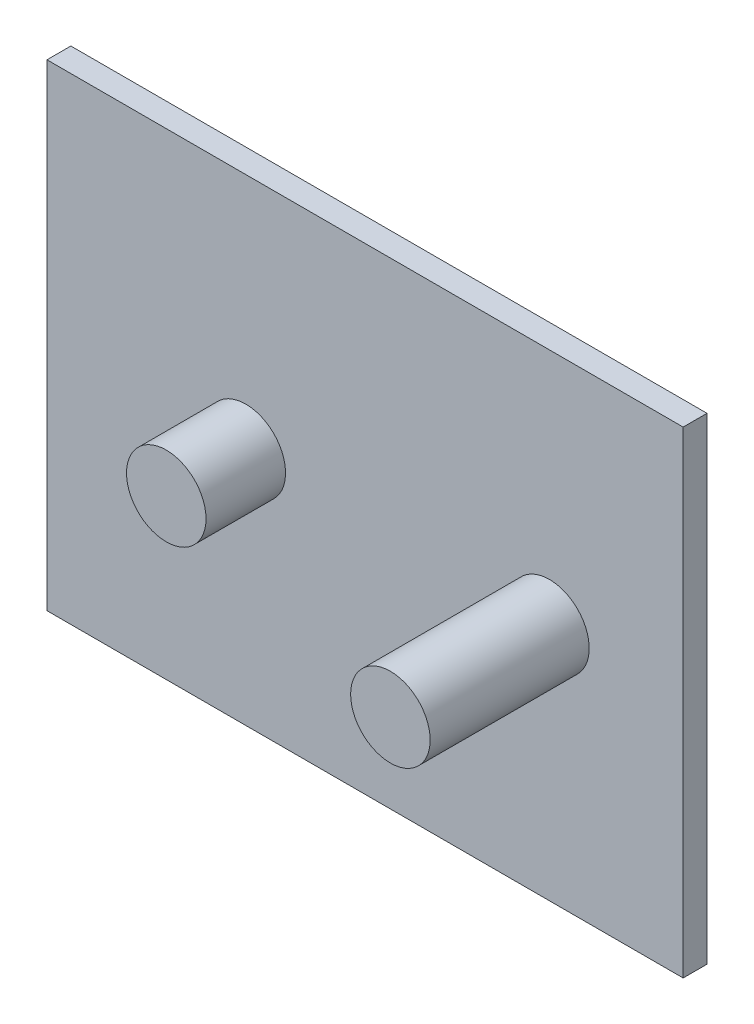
ISO-10303-21;
HEADER;
FILE_DESCRIPTION(('STEP AP214'),'2;1');
FILE_NAME('part.step','',(''),(''),'','','');
FILE_SCHEMA(('AUTOMOTIVE_DESIGN { 1 0 10303 214 1 1 1 1 }'));
ENDSEC;
DATA;
#1=APPLICATION_CONTEXT('core data for automotive mechanical design processes');
#2=APPLICATION_PROTOCOL_DEFINITION('international standard','automotive_design',2000,#1);
#3=PRODUCT_CONTEXT('',#1,'mechanical');
#4=PRODUCT('Part','Part','',(#3));
#5=PRODUCT_RELATED_PRODUCT_CATEGORY('part','',(#4));
#6=PRODUCT_DEFINITION_FORMATION('','',#4);
#7=PRODUCT_DEFINITION_CONTEXT('part definition',#1,'design');
#8=PRODUCT_DEFINITION('design','',#6,#7);
#9=PRODUCT_DEFINITION_SHAPE('','',#8);
#10=(LENGTH_UNIT() NAMED_UNIT(*) SI_UNIT(.MILLI.,.METRE.));
#11=(NAMED_UNIT(*) PLANE_ANGLE_UNIT() SI_UNIT($,.RADIAN.));
#12=(NAMED_UNIT(*) SI_UNIT($,.STERADIAN.) SOLID_ANGLE_UNIT());
#13=UNCERTAINTY_MEASURE_WITH_UNIT(LENGTH_MEASURE(1.E-05),#10,'distance_accuracy_value','');
#14=(GEOMETRIC_REPRESENTATION_CONTEXT(3) GLOBAL_UNCERTAINTY_ASSIGNED_CONTEXT((#13)) GLOBAL_UNIT_ASSIGNED_CONTEXT((#10,
#11,#12)) REPRESENTATION_CONTEXT('',''));
#15=CARTESIAN_POINT('',(0.,0.,0.));
#16=DIRECTION('',(0.,0.,1.));
#17=DIRECTION('',(1.,0.,0.));
#18=AXIS2_PLACEMENT_3D('',#15,#16,#17);
#19=CARTESIAN_POINT('',(0.,60.,3.));
#20=DIRECTION('',(0.,0.,-1.));
#21=DIRECTION('',(-1.,0.,0.));
#22=AXIS2_PLACEMENT_3D('',#19,#20,#21);
#23=PLANE('',#22);
#24=CARTESIAN_POINT('',(25.,30.,3.));
#25=DIRECTION('',(0.,0.,-1.));
#26=DIRECTION('',(-1.,0.,0.));
#27=AXIS2_PLACEMENT_3D('',#24,#25,#26);
#28=CIRCLE('',#27,5.);
#29=CARTESIAN_POINT('',(20.,30.,3.));
#30=VERTEX_POINT('',#29);
#31=EDGE_CURVE('E48',#30,#30,#28,.F.);
#32=ORIENTED_EDGE('',*,*,#31,.F.);
#33=EDGE_LOOP('',(#32));
#34=FACE_BOUND('',#33,.T.);
#35=DIRECTION('',(0.,-1.,0.));
#36=VECTOR('',#35,1.);
#37=CARTESIAN_POINT('',(0.,0.,3.));
#38=LINE('',#37,#36);
#39=CARTESIAN_POINT('',(0.,60.,3.));
#40=VERTEX_POINT('',#39);
#41=CARTESIAN_POINT('',(0.,0.,3.));
#42=VERTEX_POINT('',#41);
#43=EDGE_CURVE('E112',#40,#42,#38,.T.);
#44=ORIENTED_EDGE('',*,*,#43,.T.);
#45=DIRECTION('',(1.,0.,0.));
#46=VECTOR('',#45,1.);
#47=CARTESIAN_POINT('',(0.,0.,3.));
#48=LINE('',#47,#46);
#49=CARTESIAN_POINT('',(80.,0.,3.));
#50=VERTEX_POINT('',#49);
#51=EDGE_CURVE('E95',#42,#50,#48,.T.);
#52=ORIENTED_EDGE('',*,*,#51,.T.);
#53=DIRECTION('',(0.,1.,0.));
#54=VECTOR('',#53,1.);
#55=CARTESIAN_POINT('',(80.,0.,3.));
#56=LINE('',#55,#54);
#57=CARTESIAN_POINT('',(80.,60.,3.));
#58=VERTEX_POINT('',#57);
#59=EDGE_CURVE('E60',#50,#58,#56,.T.);
#60=ORIENTED_EDGE('',*,*,#59,.T.);
#61=DIRECTION('',(-1.,0.,0.));
#62=VECTOR('',#61,1.);
#63=CARTESIAN_POINT('',(0.,60.,3.));
#64=LINE('',#63,#62);
#65=EDGE_CURVE('E55',#58,#40,#64,.T.);
#66=ORIENTED_EDGE('',*,*,#65,.T.);
#67=EDGE_LOOP('',(#44,#52,#60,#66));
#68=FACE_BOUND('',#67,.T.);
#69=CARTESIAN_POINT('',(63.183766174,30.,3.));
#70=DIRECTION('',(0.,0.,-1.));
#71=DIRECTION('',(-1.,0.,0.));
#72=AXIS2_PLACEMENT_3D('',#69,#70,#71);
#73=CIRCLE('',#72,5.);
#74=CARTESIAN_POINT('',(58.183766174,30.,3.));
#75=VERTEX_POINT('',#74);
#76=EDGE_CURVE('E11',#75,#75,#73,.F.);
#77=ORIENTED_EDGE('',*,*,#76,.F.);
#78=EDGE_LOOP('',(#77));
#79=FACE_BOUND('',#78,.T.);
#80=ADVANCED_FACE('F40',(#34,#68,#79),#23,.F.);
#81=CARTESIAN_POINT('',(0.,0.,3.));
#82=DIRECTION('',(1.,0.,0.));
#83=DIRECTION('',(0.,0.,-1.));
#84=AXIS2_PLACEMENT_3D('',#81,#82,#83);
#85=PLANE('',#84);
#86=DIRECTION('',(0.,-1.,0.));
#87=VECTOR('',#86,1.);
#88=CARTESIAN_POINT('',(0.,0.,0.));
#89=LINE('',#88,#87);
#90=CARTESIAN_POINT('',(0.,60.,0.));
#91=VERTEX_POINT('',#90);
#92=CARTESIAN_POINT('',(0.,0.,0.));
#93=VERTEX_POINT('',#92);
#94=EDGE_CURVE('E86',#91,#93,#89,.T.);
#95=ORIENTED_EDGE('',*,*,#94,.T.);
#96=DIRECTION('',(0.,0.,-1.));
#97=VECTOR('',#96,1.);
#98=CARTESIAN_POINT('',(0.,0.,3.));
#99=LINE('',#98,#97);
#100=EDGE_CURVE('E93',#42,#93,#99,.T.);
#101=ORIENTED_EDGE('',*,*,#100,.F.);
#102=ORIENTED_EDGE('',*,*,#43,.F.);
#103=DIRECTION('',(0.,0.,-1.));
#104=VECTOR('',#103,1.);
#105=CARTESIAN_POINT('',(0.,60.,3.));
#106=LINE('',#105,#104);
#107=EDGE_CURVE('E101',#40,#91,#106,.T.);
#108=ORIENTED_EDGE('',*,*,#107,.T.);
#109=EDGE_LOOP('',(#95,#101,#102,#108));
#110=FACE_BOUND('',#109,.T.);
#111=ADVANCED_FACE('F42',(#110),#85,.F.);
#112=CARTESIAN_POINT('',(0.,0.,3.));
#113=DIRECTION('',(0.,1.,0.));
#114=DIRECTION('',(0.,0.,1.));
#115=AXIS2_PLACEMENT_3D('',#112,#113,#114);
#116=PLANE('',#115);
#117=DIRECTION('',(1.,0.,0.));
#118=VECTOR('',#117,1.);
#119=CARTESIAN_POINT('',(0.,0.,0.));
#120=LINE('',#119,#118);
#121=CARTESIAN_POINT('',(80.,0.,0.));
#122=VERTEX_POINT('',#121);
#123=EDGE_CURVE('E81',#93,#122,#120,.T.);
#124=ORIENTED_EDGE('',*,*,#123,.T.);
#125=DIRECTION('',(0.,0.,-1.));
#126=VECTOR('',#125,1.);
#127=CARTESIAN_POINT('',(80.,0.,3.));
#128=LINE('',#127,#126);
#129=EDGE_CURVE('E98',#50,#122,#128,.T.);
#130=ORIENTED_EDGE('',*,*,#129,.F.);
#131=ORIENTED_EDGE('',*,*,#51,.F.);
#132=ORIENTED_EDGE('',*,*,#100,.T.);
#133=EDGE_LOOP('',(#124,#130,#131,#132));
#134=FACE_BOUND('',#133,.T.);
#135=ADVANCED_FACE('F94',(#134),#116,.F.);
#136=CARTESIAN_POINT('',(80.,0.,3.));
#137=DIRECTION('',(-1.,0.,0.));
#138=DIRECTION('',(0.,0.,1.));
#139=AXIS2_PLACEMENT_3D('',#136,#137,#138);
#140=PLANE('',#139);
#141=DIRECTION('',(0.,1.,0.));
#142=VECTOR('',#141,1.);
#143=CARTESIAN_POINT('',(80.,0.,0.));
#144=LINE('',#143,#142);
#145=CARTESIAN_POINT('',(80.,60.,0.));
#146=VERTEX_POINT('',#145);
#147=EDGE_CURVE('E87',#122,#146,#144,.T.);
#148=ORIENTED_EDGE('',*,*,#147,.T.);
#149=DIRECTION('',(0.,0.,-1.));
#150=VECTOR('',#149,1.);
#151=CARTESIAN_POINT('',(80.,60.,3.));
#152=LINE('',#151,#150);
#153=EDGE_CURVE('E118',#58,#146,#152,.T.);
#154=ORIENTED_EDGE('',*,*,#153,.F.);
#155=ORIENTED_EDGE('',*,*,#59,.F.);
#156=ORIENTED_EDGE('',*,*,#129,.T.);
#157=EDGE_LOOP('',(#148,#154,#155,#156));
#158=FACE_BOUND('',#157,.T.);
#159=ADVANCED_FACE('F156',(#158),#140,.F.);
#160=CARTESIAN_POINT('',(0.,60.,3.));
#161=DIRECTION('',(0.,-1.,0.));
#162=DIRECTION('',(0.,0.,-1.));
#163=AXIS2_PLACEMENT_3D('',#160,#161,#162);
#164=PLANE('',#163);
#165=DIRECTION('',(-1.,0.,0.));
#166=VECTOR('',#165,1.);
#167=CARTESIAN_POINT('',(0.,60.,0.));
#168=LINE('',#167,#166);
#169=EDGE_CURVE('E110',#146,#91,#168,.T.);
#170=ORIENTED_EDGE('',*,*,#169,.T.);
#171=ORIENTED_EDGE('',*,*,#107,.F.);
#172=ORIENTED_EDGE('',*,*,#65,.F.);
#173=ORIENTED_EDGE('',*,*,#153,.T.);
#174=EDGE_LOOP('',(#170,#171,#172,#173));
#175=FACE_BOUND('',#174,.T.);
#176=ADVANCED_FACE('F152',(#175),#164,.F.);
#177=CARTESIAN_POINT('',(0.,60.,0.));
#178=DIRECTION('',(0.,0.,-1.));
#179=DIRECTION('',(-1.,0.,0.));
#180=AXIS2_PLACEMENT_3D('',#177,#178,#179);
#181=PLANE('',#180);
#182=ORIENTED_EDGE('',*,*,#94,.F.);
#183=ORIENTED_EDGE('',*,*,#169,.F.);
#184=ORIENTED_EDGE('',*,*,#147,.F.);
#185=ORIENTED_EDGE('',*,*,#123,.F.);
#186=EDGE_LOOP('',(#182,#183,#184,#185));
#187=FACE_BOUND('',#186,.T.);
#188=ADVANCED_FACE('F83',(#187),#181,.T.);
#189=CARTESIAN_POINT('',(25.,30.,13.));
#190=DIRECTION('',(0.,0.,-1.));
#191=DIRECTION('',(-1.,0.,0.));
#192=AXIS2_PLACEMENT_3D('',#189,#190,#191);
#193=CYLINDRICAL_SURFACE('',#192,5.);
#194=CARTESIAN_POINT('',(25.,30.,13.));
#195=DIRECTION('',(0.,0.,1.));
#196=DIRECTION('',(1.,0.,0.));
#197=AXIS2_PLACEMENT_3D('',#194,#195,#196);
#198=CIRCLE('',#197,5.);
#199=CARTESIAN_POINT('',(30.,30.,13.));
#200=VERTEX_POINT('',#199);
#201=EDGE_CURVE('E102',#200,#200,#198,.T.);
#202=ORIENTED_EDGE('',*,*,#201,.F.);
#203=EDGE_LOOP('',(#202));
#204=FACE_BOUND('',#203,.T.);
#205=ORIENTED_EDGE('',*,*,#31,.T.);
#206=EDGE_LOOP('',(#205));
#207=FACE_BOUND('',#206,.T.);
#208=ADVANCED_FACE('F124',(#204,#207),#193,.T.);
#209=CARTESIAN_POINT('',(25.,30.,13.));
#210=DIRECTION('',(0.,0.,1.));
#211=DIRECTION('',(1.,0.,0.));
#212=AXIS2_PLACEMENT_3D('',#209,#210,#211);
#213=PLANE('',#212);
#214=ORIENTED_EDGE('',*,*,#201,.T.);
#215=EDGE_LOOP('',(#214));
#216=FACE_BOUND('',#215,.T.);
#217=ADVANCED_FACE('F135',(#216),#213,.T.);
#218=CARTESIAN_POINT('',(63.183766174,30.,13.));
#219=DIRECTION('',(0.,0.,-1.));
#220=DIRECTION('',(-1.,0.,0.));
#221=AXIS2_PLACEMENT_3D('',#218,#219,#220);
#222=CYLINDRICAL_SURFACE('',#221,5.);
#223=ORIENTED_EDGE('',*,*,#76,.T.);
#224=EDGE_LOOP('',(#223));
#225=FACE_BOUND('',#224,.T.);
#226=CARTESIAN_POINT('',(63.183766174,30.,23.));
#227=DIRECTION('',(0.,0.,1.));
#228=DIRECTION('',(1.,0.,0.));
#229=AXIS2_PLACEMENT_3D('',#226,#227,#228);
#230=CIRCLE('',#229,5.);
#231=CARTESIAN_POINT('',(68.183766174,30.,23.));
#232=VERTEX_POINT('',#231);
#233=EDGE_CURVE('E105',#232,#232,#230,.T.);
#234=ORIENTED_EDGE('',*,*,#233,.F.);
#235=EDGE_LOOP('',(#234));
#236=FACE_BOUND('',#235,.T.);
#237=ADVANCED_FACE('F131',(#225,#236),#222,.T.);
#238=CARTESIAN_POINT('',(63.183766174,30.,23.));
#239=DIRECTION('',(0.,0.,1.));
#240=DIRECTION('',(1.,0.,0.));
#241=AXIS2_PLACEMENT_3D('',#238,#239,#240);
#242=PLANE('',#241);
#243=ORIENTED_EDGE('',*,*,#233,.T.);
#244=EDGE_LOOP('',(#243));
#245=FACE_BOUND('',#244,.T.);
#246=ADVANCED_FACE('F134',(#245),#242,.T.);
#247=CLOSED_SHELL('',(#80,#111,#135,#159,#176,#188,#208,#217,#237,#246));
#248=MANIFOLD_SOLID_BREP('B2',#247);
#249=ADVANCED_BREP_SHAPE_REPRESENTATION('',(#18,#248),#14);
#250=SHAPE_DEFINITION_REPRESENTATION(#9,#249);
ENDSEC;
END-ISO-10303-21;
